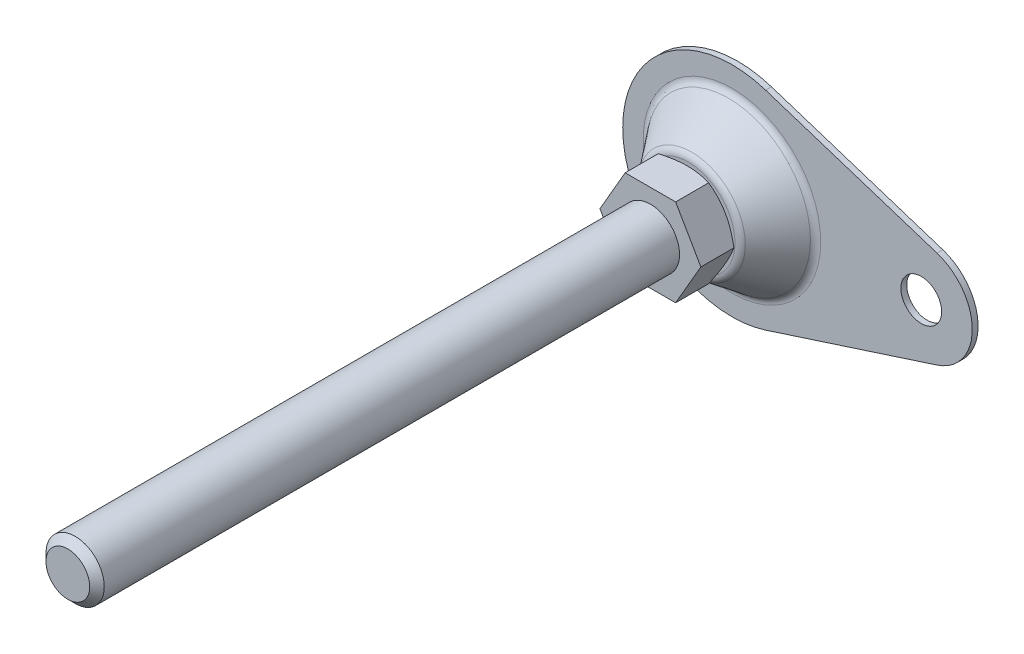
ISO-10303-21;
HEADER;
FILE_DESCRIPTION(('STEP AP214'),'2;1');
FILE_NAME('part.step','',(''),(''),'','','');
FILE_SCHEMA(('AUTOMOTIVE_DESIGN { 1 0 10303 214 1 1 1 1 }'));
ENDSEC;
DATA;
#1=APPLICATION_CONTEXT('core data for automotive mechanical design processes');
#2=APPLICATION_PROTOCOL_DEFINITION('international standard','automotive_design',2000,#1);
#3=PRODUCT_CONTEXT('',#1,'mechanical');
#4=PRODUCT('Part','Part','',(#3));
#5=PRODUCT_RELATED_PRODUCT_CATEGORY('part','',(#4));
#6=PRODUCT_DEFINITION_FORMATION('','',#4);
#7=PRODUCT_DEFINITION_CONTEXT('part definition',#1,'design');
#8=PRODUCT_DEFINITION('design','',#6,#7);
#9=PRODUCT_DEFINITION_SHAPE('','',#8);
#10=(LENGTH_UNIT() NAMED_UNIT(*) SI_UNIT(.MILLI.,.METRE.));
#11=(NAMED_UNIT(*) PLANE_ANGLE_UNIT() SI_UNIT($,.RADIAN.));
#12=(NAMED_UNIT(*) SI_UNIT($,.STERADIAN.) SOLID_ANGLE_UNIT());
#13=UNCERTAINTY_MEASURE_WITH_UNIT(LENGTH_MEASURE(1.E-05),#10,'distance_accuracy_value','');
#14=(GEOMETRIC_REPRESENTATION_CONTEXT(3) GLOBAL_UNCERTAINTY_ASSIGNED_CONTEXT((#13)) GLOBAL_UNIT_ASSIGNED_CONTEXT((#10,
#11,#12)) REPRESENTATION_CONTEXT('',''));
#15=CARTESIAN_POINT('',(0.,0.,0.));
#16=DIRECTION('',(0.,0.,1.));
#17=DIRECTION('',(1.,0.,0.));
#18=AXIS2_PLACEMENT_3D('',#15,#16,#17);
#19=CARTESIAN_POINT('',(65.,0.,2.));
#20=DIRECTION('',(0.,0.,1.));
#21=DIRECTION('',(1.,0.,0.));
#22=AXIS2_PLACEMENT_3D('',#19,#20,#21);
#23=PLANE('',#22);
#24=CARTESIAN_POINT('',(0.,0.,2.));
#25=DIRECTION('',(0.,0.,1.));
#26=DIRECTION('',(1.,0.,0.));
#27=AXIS2_PLACEMENT_3D('',#24,#25,#26);
#28=CIRCLE('',#27,30.4802116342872);
#29=CARTESIAN_POINT('',(30.4802116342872,0.,2.));
#30=VERTEX_POINT('',#29);
#31=EDGE_CURVE('E245',#30,#30,#28,.F.);
#32=ORIENTED_EDGE('',*,*,#31,.T.);
#33=EDGE_LOOP('',(#32));
#34=FACE_BOUND('',#33,.T.);
#35=CARTESIAN_POINT('',(65.,0.,2.));
#36=DIRECTION('',(0.,0.,1.));
#37=DIRECTION('',(1.,0.,0.));
#38=AXIS2_PLACEMENT_3D('',#35,#36,#37);
#39=CIRCLE('',#38,7.);
#40=CARTESIAN_POINT('',(72.,0.,2.));
#41=VERTEX_POINT('',#40);
#42=EDGE_CURVE('E262',#41,#41,#39,.T.);
#43=ORIENTED_EDGE('',*,*,#42,.F.);
#44=EDGE_LOOP('',(#43));
#45=FACE_BOUND('',#44,.T.);
#46=DIRECTION('',(-0.951485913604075,0.307692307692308,0.));
#47=VECTOR('',#46,1.);
#48=CARTESIAN_POINT('',(11.5384615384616,35.6807217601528,2.));
#49=LINE('',#48,#47);
#50=CARTESIAN_POINT('',(70.3846153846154,16.6510034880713,2.));
#51=VERTEX_POINT('',#50);
#52=CARTESIAN_POINT('',(11.5384615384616,35.6807217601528,2.));
#53=VERTEX_POINT('',#52);
#54=EDGE_CURVE('E112',#51,#53,#49,.T.);
#55=ORIENTED_EDGE('',*,*,#54,.T.);
#56=CARTESIAN_POINT('',(0.,0.,2.));
#57=DIRECTION('',(0.,0.,1.));
#58=DIRECTION('',(1.,0.,0.));
#59=AXIS2_PLACEMENT_3D('',#56,#57,#58);
#60=CIRCLE('',#59,37.5);
#61=CARTESIAN_POINT('',(11.5384615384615,-35.6807217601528,2.));
#62=VERTEX_POINT('',#61);
#63=EDGE_CURVE('E114',#53,#62,#60,.T.);
#64=ORIENTED_EDGE('',*,*,#63,.T.);
#65=DIRECTION('',(0.951485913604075,0.307692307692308,0.));
#66=VECTOR('',#65,1.);
#67=CARTESIAN_POINT('',(11.5384615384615,-35.6807217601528,2.));
#68=LINE('',#67,#66);
#69=CARTESIAN_POINT('',(70.3846153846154,-16.6510034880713,2.));
#70=VERTEX_POINT('',#69);
#71=EDGE_CURVE('E97',#62,#70,#68,.T.);
#72=ORIENTED_EDGE('',*,*,#71,.T.);
#73=CARTESIAN_POINT('',(65.,0.,2.));
#74=DIRECTION('',(0.,0.,1.));
#75=DIRECTION('',(1.,0.,0.));
#76=AXIS2_PLACEMENT_3D('',#73,#74,#75);
#77=CIRCLE('',#76,17.5);
#78=EDGE_CURVE('E106',#70,#51,#77,.T.);
#79=ORIENTED_EDGE('',*,*,#78,.T.);
#80=EDGE_LOOP('',(#55,#64,#72,#79));
#81=FACE_BOUND('',#80,.T.);
#82=ADVANCED_FACE('F14',(#34,#45,#81),#23,.T.);
#83=CARTESIAN_POINT('',(65.,0.,0.));
#84=DIRECTION('',(0.,0.,1.));
#85=DIRECTION('',(1.,0.,0.));
#86=AXIS2_PLACEMENT_3D('',#83,#84,#85);
#87=PLANE('',#86);
#88=CARTESIAN_POINT('',(65.,0.,0.));
#89=DIRECTION('',(0.,0.,1.));
#90=DIRECTION('',(1.,0.,0.));
#91=AXIS2_PLACEMENT_3D('',#88,#89,#90);
#92=CIRCLE('',#91,7.);
#93=CARTESIAN_POINT('',(72.,0.,0.));
#94=VERTEX_POINT('',#93);
#95=EDGE_CURVE('E258',#94,#94,#92,.T.);
#96=ORIENTED_EDGE('',*,*,#95,.T.);
#97=EDGE_LOOP('',(#96));
#98=FACE_BOUND('',#97,.T.);
#99=CARTESIAN_POINT('',(0.,0.,0.));
#100=DIRECTION('',(0.,0.,1.));
#101=DIRECTION('',(1.,0.,0.));
#102=AXIS2_PLACEMENT_3D('',#99,#100,#101);
#103=CIRCLE('',#102,37.5);
#104=CARTESIAN_POINT('',(11.5384615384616,35.6807217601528,0.));
#105=VERTEX_POINT('',#104);
#106=CARTESIAN_POINT('',(11.5384615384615,-35.6807217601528,0.));
#107=VERTEX_POINT('',#106);
#108=EDGE_CURVE('E275',#105,#107,#103,.T.);
#109=ORIENTED_EDGE('',*,*,#108,.F.);
#110=DIRECTION('',(-0.951485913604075,0.307692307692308,0.));
#111=VECTOR('',#110,1.);
#112=CARTESIAN_POINT('',(70.3846153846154,16.6510034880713,0.));
#113=LINE('',#112,#111);
#114=CARTESIAN_POINT('',(70.3846153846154,16.6510034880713,0.));
#115=VERTEX_POINT('',#114);
#116=EDGE_CURVE('E9',#115,#105,#113,.T.);
#117=ORIENTED_EDGE('',*,*,#116,.F.);
#118=CARTESIAN_POINT('',(65.,0.,0.));
#119=DIRECTION('',(0.,0.,1.));
#120=DIRECTION('',(1.,0.,0.));
#121=AXIS2_PLACEMENT_3D('',#118,#119,#120);
#122=CIRCLE('',#121,17.5);
#123=CARTESIAN_POINT('',(70.3846153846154,-16.6510034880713,0.));
#124=VERTEX_POINT('',#123);
#125=EDGE_CURVE('E22',#124,#115,#122,.T.);
#126=ORIENTED_EDGE('',*,*,#125,.F.);
#127=DIRECTION('',(0.951485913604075,0.307692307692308,0.));
#128=VECTOR('',#127,1.);
#129=CARTESIAN_POINT('',(70.3846153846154,-16.6510034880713,0.));
#130=LINE('',#129,#128);
#131=EDGE_CURVE('E99',#107,#124,#130,.T.);
#132=ORIENTED_EDGE('',*,*,#131,.F.);
#133=EDGE_LOOP('',(#109,#117,#126,#132));
#134=FACE_BOUND('',#133,.T.);
#135=ADVANCED_FACE('F215',(#98,#134),#87,.F.);
#136=CARTESIAN_POINT('',(0.,0.,17.));
#137=DIRECTION('',(0.,0.,-1.));
#138=DIRECTION('',(-1.,0.,0.));
#139=AXIS2_PLACEMENT_3D('',#136,#137,#138);
#140=PLANE('',#139);
#141=CARTESIAN_POINT('',(0.,0.,17.));
#142=DIRECTION('',(0.,0.,-1.));
#143=DIRECTION('',(-1.,0.,0.));
#144=AXIS2_PLACEMENT_3D('',#141,#142,#143);
#145=CIRCLE('',#144,16.0197883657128);
#146=CARTESIAN_POINT('',(-16.0197883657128,0.,17.));
#147=VERTEX_POINT('',#146);
#148=EDGE_CURVE('E278',#147,#147,#145,.F.);
#149=ORIENTED_EDGE('',*,*,#148,.T.);
#150=EDGE_LOOP('',(#149));
#151=FACE_BOUND('',#150,.T.);
#152=CARTESIAN_POINT('',(0.,0.,17.));
#153=DIRECTION('',(0.,0.,-1.));
#154=DIRECTION('',(-1.,0.,0.));
#155=AXIS2_PLACEMENT_3D('',#152,#153,#154);
#156=CIRCLE('',#155,14.5);
#157=CARTESIAN_POINT('',(-14.5,0.,17.));
#158=VERTEX_POINT('',#157);
#159=EDGE_CURVE('E122',#158,#158,#156,.T.);
#160=ORIENTED_EDGE('',*,*,#159,.T.);
#161=EDGE_LOOP('',(#160));
#162=FACE_BOUND('',#161,.T.);
#163=ADVANCED_FACE('F211',(#151,#162),#140,.F.);
#164=CARTESIAN_POINT('',(0.,0.,5.));
#165=DIRECTION('',(0.,0.,1.));
#166=DIRECTION('',(1.,0.,0.));
#167=AXIS2_PLACEMENT_3D('',#164,#165,#166);
#168=TOROIDAL_SURFACE('',#167,30.4802116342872,3.);
#169=CARTESIAN_POINT('',(0.,0.,3.1747053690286));
#170=DIRECTION('',(0.,0.,1.));
#171=DIRECTION('',(1.,0.,0.));
#172=AXIS2_PLACEMENT_3D('',#169,#170,#171);
#173=CIRCLE('',#172,28.0993925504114);
#174=CARTESIAN_POINT('',(28.0993925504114,0.,3.1747053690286));
#175=VERTEX_POINT('',#174);
#176=EDGE_CURVE('E242',#175,#175,#173,.T.);
#177=ORIENTED_EDGE('',*,*,#176,.F.);
#178=EDGE_LOOP('',(#177));
#179=FACE_BOUND('',#178,.T.);
#180=ORIENTED_EDGE('',*,*,#31,.F.);
#181=EDGE_LOOP('',(#180));
#182=FACE_BOUND('',#181,.T.);
#183=ADVANCED_FACE('F214',(#179,#182),#168,.F.);
#184=CARTESIAN_POINT('',(0.,0.,14.));
#185=DIRECTION('',(0.,0.,-1.));
#186=DIRECTION('',(-1.,0.,0.));
#187=AXIS2_PLACEMENT_3D('',#184,#185,#186);
#188=TOROIDAL_SURFACE('',#187,16.0197883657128,3.);
#189=ORIENTED_EDGE('',*,*,#148,.F.);
#190=EDGE_LOOP('',(#189));
#191=FACE_BOUND('',#190,.T.);
#192=CARTESIAN_POINT('',(0.,0.,15.8252946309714));
#193=DIRECTION('',(0.,0.,1.));
#194=DIRECTION('',(1.,0.,0.));
#195=AXIS2_PLACEMENT_3D('',#192,#193,#194);
#196=CIRCLE('',#195,18.4006074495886);
#197=CARTESIAN_POINT('',(18.4006074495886,0.,15.8252946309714));
#198=VERTEX_POINT('',#197);
#199=EDGE_CURVE('E251',#198,#198,#196,.F.);
#200=ORIENTED_EDGE('',*,*,#199,.F.);
#201=EDGE_LOOP('',(#200));
#202=FACE_BOUND('',#201,.T.);
#203=ADVANCED_FACE('F229',(#191,#202),#188,.T.);
#204=CARTESIAN_POINT('',(0.,0.,2.));
#205=DIRECTION('',(0.,0.,-1.));
#206=DIRECTION('',(-1.,0.,0.));
#207=AXIS2_PLACEMENT_3D('',#204,#205,#206);
#208=CYLINDRICAL_SURFACE('',#207,37.5);
#209=ORIENTED_EDGE('',*,*,#108,.T.);
#210=DIRECTION('',(0.,0.,1.));
#211=VECTOR('',#210,1.);
#212=CARTESIAN_POINT('',(11.5384615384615,-35.6807217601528,-8.));
#213=LINE('',#212,#211);
#214=EDGE_CURVE('E103',#107,#62,#213,.T.);
#215=ORIENTED_EDGE('',*,*,#214,.T.);
#216=ORIENTED_EDGE('',*,*,#63,.F.);
#217=DIRECTION('',(0.,0.,1.));
#218=VECTOR('',#217,1.);
#219=CARTESIAN_POINT('',(11.5384615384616,35.6807217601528,-8.));
#220=LINE('',#219,#218);
#221=EDGE_CURVE('E119',#105,#53,#220,.T.);
#222=ORIENTED_EDGE('',*,*,#221,.F.);
#223=EDGE_LOOP('',(#209,#215,#216,#222));
#224=FACE_BOUND('',#223,.T.);
#225=ADVANCED_FACE('F219',(#224),#208,.T.);
#226=CARTESIAN_POINT('',(65.,0.,2.));
#227=DIRECTION('',(0.,0.,-1.));
#228=DIRECTION('',(-1.,0.,0.));
#229=AXIS2_PLACEMENT_3D('',#226,#227,#228);
#230=CYLINDRICAL_SURFACE('',#229,7.);
#231=ORIENTED_EDGE('',*,*,#42,.T.);
#232=EDGE_LOOP('',(#231));
#233=FACE_BOUND('',#232,.T.);
#234=ORIENTED_EDGE('',*,*,#95,.F.);
#235=EDGE_LOOP('',(#234));
#236=FACE_BOUND('',#235,.T.);
#237=ADVANCED_FACE('F209',(#233,#236),#230,.F.);
#238=CARTESIAN_POINT('',(0.,0.,2.));
#239=DIRECTION('',(0.,0.,-1.));
#240=DIRECTION('',(-1.,0.,0.));
#241=AXIS2_PLACEMENT_3D('',#238,#239,#240);
#242=CONICAL_SURFACE('',#241,29.,0.654082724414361);
#243=ORIENTED_EDGE('',*,*,#176,.T.);
#244=EDGE_LOOP('',(#243));
#245=FACE_BOUND('',#244,.T.);
#246=ORIENTED_EDGE('',*,*,#199,.T.);
#247=EDGE_LOOP('',(#246));
#248=FACE_BOUND('',#247,.T.);
#249=ADVANCED_FACE('F151',(#245,#248),#242,.T.);
#250=CARTESIAN_POINT('',(0.,0.,17.));
#251=DIRECTION('',(0.,0.,1.));
#252=DIRECTION('',(1.,0.,0.));
#253=AXIS2_PLACEMENT_3D('',#250,#251,#252);
#254=CONICAL_SURFACE('',#253,14.5,1.0471975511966);
#255=ORIENTED_EDGE('',*,*,#159,.F.);
#256=EDGE_LOOP('',(#255));
#257=FACE_BOUND('',#256,.T.);
#258=CARTESIAN_POINT('',(17.3206235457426,0.000200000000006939,18.6284877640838));
#259=CARTESIAN_POINT('',(17.130274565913,-0.329494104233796,18.5185969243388));
#260=CARTESIAN_POINT('',(16.939183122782,-0.660474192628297,18.4136927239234));
#261=CARTESIAN_POINT('',(16.5554679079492,-1.32508844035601,18.2152437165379));
#262=CARTESIAN_POINT('',(16.3628436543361,-1.6587234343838,18.1217026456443));
#263=CARTESIAN_POINT('',(15.9756905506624,-2.32929228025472,17.9472372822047));
#264=CARTESIAN_POINT('',(15.7811583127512,-2.66623200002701,17.866342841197));
#265=CARTESIAN_POINT('',(15.3907420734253,-3.34245276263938,17.7189077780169));
#266=CARTESIAN_POINT('',(15.1948581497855,-3.68173367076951,17.6523663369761));
#267=CARTESIAN_POINT('',(14.8067578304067,-4.35394314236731,17.5364675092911));
#268=CARTESIAN_POINT('',(14.6145702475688,-4.68682180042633,17.4867265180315));
#269=CARTESIAN_POINT('',(14.2293144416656,-5.35410443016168,17.4033218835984));
#270=CARTESIAN_POINT('',(14.0362462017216,-5.68850843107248,17.3696585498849));
#271=CARTESIAN_POINT('',(13.6497853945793,-6.35787818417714,17.3192592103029));
#272=CARTESIAN_POINT('',(13.4563934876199,-6.69284279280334,17.3025030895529));
#273=CARTESIAN_POINT('',(13.0694311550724,-7.36308121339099,17.2862785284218));
#274=CARTESIAN_POINT('',(12.8758607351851,-7.69835501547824,17.2868095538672));
#275=CARTESIAN_POINT('',(12.5139822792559,-8.3251468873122,17.303951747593));
#276=CARTESIAN_POINT('',(12.3456484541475,-8.61670962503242,17.3184719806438));
#277=CARTESIAN_POINT('',(12.0093680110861,-9.19916443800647,17.3603122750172));
#278=CARTESIAN_POINT('',(11.8414214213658,-9.49005646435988,17.3876332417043));
#279=CARTESIAN_POINT('',(11.5060066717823,-10.0710118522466,17.4545986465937));
#280=CARTESIAN_POINT('',(11.338539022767,-10.3610743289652,17.4942532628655));
#281=CARTESIAN_POINT('',(11.0043888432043,-10.939839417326,17.5851902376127));
#282=CARTESIAN_POINT('',(10.8377063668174,-11.2285419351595,17.6364733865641));
#283=CARTESIAN_POINT('',(10.3317324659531,-12.1049144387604,17.8090619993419));
#284=CARTESIAN_POINT('',(9.99390625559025,-12.6900465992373,17.9475763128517));
#285=CARTESIAN_POINT('',(9.32329122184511,-13.8515859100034,18.26194710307));
#286=CARTESIAN_POINT('',(8.99049381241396,-14.4280079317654,18.4377297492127));
#287=CARTESIAN_POINT('',(8.66013856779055,-15.0002,18.6284877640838));
#288=B_SPLINE_CURVE_WITH_KNOTS('',3,(#258,#259,#260,#261,#262,#263,#264,#265,#266,#267,#268,
#269,#270,#271,#272,#273,#274,#275,#276,#277,#278,#279,#280,#281,#282,#283,#284,#285,#286,#287),
.UNSPECIFIED.,.F.,.F.,(4,2,2,2,2,2,2,2,2,2,2,2,2,2,4),(0.,1.18875411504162,2.37789802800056,
3.56980778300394,4.76164951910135,5.92407379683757,7.0865204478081,8.24758247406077,
9.40860862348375,10.4193068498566,11.4300765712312,12.4416826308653,13.4533574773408,
15.5211962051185,17.5849760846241),.UNSPECIFIED.);
#289=CARTESIAN_POINT('',(17.3205080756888,0.,18.6284210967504));
#290=VERTEX_POINT('',#289);
#291=CARTESIAN_POINT('',(8.66025403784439,-15.,18.6284210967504));
#292=VERTEX_POINT('',#291);
#293=EDGE_CURVE('E29',#290,#292,#288,.T.);
#294=ORIENTED_EDGE('',*,*,#293,.T.);
#295=CARTESIAN_POINT('',(-23.3586985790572,-15.,24.6557810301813));
#296=CARTESIAN_POINT('',(-23.0306759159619,-15.,24.4964278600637));
#297=CARTESIAN_POINT('',(-22.7022708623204,-15.,24.3378621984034));
#298=CARTESIAN_POINT('',(-22.0446161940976,-15.,24.0224840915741));
#299=CARTESIAN_POINT('',(-21.7153665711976,-15.,23.8656716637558));
#300=CARTESIAN_POINT('',(-20.7261447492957,-15.,23.3980907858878));
#301=CARTESIAN_POINT('',(-20.0647952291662,-15.,23.090225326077));
#302=CARTESIAN_POINT('',(-18.7341494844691,-15.,22.4824434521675));
#303=CARTESIAN_POINT('',(-18.0648296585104,-15.,22.1825785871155));
#304=CARTESIAN_POINT('',(-16.7208994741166,-15.,21.594991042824));
#305=CARTESIAN_POINT('',(-16.0462893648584,-15.,21.3072677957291));
#306=CARTESIAN_POINT('',(-14.668785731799,-15.,20.7381173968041));
#307=CARTESIAN_POINT('',(-13.9656828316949,-15.,20.4571943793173));
#308=CARTESIAN_POINT('',(-12.551282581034,-15.,19.9163766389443));
#309=CARTESIAN_POINT('',(-11.8399843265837,-15.,19.6564842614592));
#310=CARTESIAN_POINT('',(-10.4093840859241,-15.,19.1644824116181));
#311=CARTESIAN_POINT('',(-9.69010129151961,-15.,18.9323175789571));
#312=CARTESIAN_POINT('',(-8.24115179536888,-15.,18.5031423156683));
#313=CARTESIAN_POINT('',(-7.51148840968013,-15.,18.3061209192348));
#314=CARTESIAN_POINT('',(-6.41103708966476,-15.,18.0445520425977));
#315=CARTESIAN_POINT('',(-6.04422074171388,-15.,17.9631963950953));
#316=CARTESIAN_POINT('',(-5.308063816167,-15.,17.8127743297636));
#317=CARTESIAN_POINT('',(-4.9387232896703,-15.,17.7437076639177));
#318=CARTESIAN_POINT('',(-4.19776624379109,-15.,17.6190768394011));
#319=CARTESIAN_POINT('',(-3.82614976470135,-15.,17.5635124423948));
#320=CARTESIAN_POINT('',(-3.08102773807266,-15.,17.4669909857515));
#321=CARTESIAN_POINT('',(-2.70752227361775,-15.,17.426033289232));
#322=CARTESIAN_POINT('',(-1.96406382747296,-15.,17.3600577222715));
#323=CARTESIAN_POINT('',(-1.59412898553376,-15.,17.3348366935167));
#324=CARTESIAN_POINT('',(-0.853524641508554,-15.,17.300066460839));
#325=CARTESIAN_POINT('',(-0.482855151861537,-15.,17.2905169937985));
#326=CARTESIAN_POINT('',(0.25855959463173,-15.,17.287317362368));
#327=CARTESIAN_POINT('',(0.629304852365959,-15.,17.2936673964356));
#328=CARTESIAN_POINT('',(1.37019516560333,-15.,17.3221110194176));
#329=CARTESIAN_POINT('',(1.7403401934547,-15.,17.3442053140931));
#330=CARTESIAN_POINT('',(2.62681140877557,-15.,17.4155020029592));
#331=CARTESIAN_POINT('',(3.14256120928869,-15.,17.4720015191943));
#332=CARTESIAN_POINT('',(4.17030104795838,-15.,17.6125153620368));
#333=CARTESIAN_POINT('',(4.68229057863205,-15.,17.6965333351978));
#334=CARTESIAN_POINT('',(5.70198989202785,-15.,17.8890956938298));
#335=CARTESIAN_POINT('',(6.20969617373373,-15.,17.9976584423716));
#336=CARTESIAN_POINT('',(7.22005088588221,-15.,18.2359950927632));
#337=CARTESIAN_POINT('',(7.72269938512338,-15.,18.3657687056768));
#338=CARTESIAN_POINT('',(8.73446067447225,-15.,18.6465622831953));
#339=CARTESIAN_POINT('',(9.24345603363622,-15.,18.7980024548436));
#340=CARTESIAN_POINT('',(10.2564317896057,-15.,19.1167327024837));
#341=CARTESIAN_POINT('',(10.7604121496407,-15.,19.2840228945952));
#342=CARTESIAN_POINT('',(11.763609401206,-15.,19.631778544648));
#343=CARTESIAN_POINT('',(12.262827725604,-15.,19.8122398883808));
#344=CARTESIAN_POINT('',(13.2571080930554,-15.,20.1841942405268));
#345=CARTESIAN_POINT('',(13.7521702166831,-15.,20.37568703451));
#346=CARTESIAN_POINT('',(15.0416273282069,-15.,20.8883338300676));
#347=CARTESIAN_POINT('',(15.8330826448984,-15.,21.2168757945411));
#348=CARTESIAN_POINT('',(17.4082740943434,-15.,21.892031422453));
#349=CARTESIAN_POINT('',(18.1920094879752,-15.,22.238646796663));
#350=CARTESIAN_POINT('',(19.7534528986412,-15.,22.9458287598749));
#351=CARTESIAN_POINT('',(20.5311588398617,-15.,23.3063999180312));
#352=CARTESIAN_POINT('',(22.0814515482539,-15.,24.0382834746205));
#353=CARTESIAN_POINT('',(22.854038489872,-15.,24.409595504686));
#354=CARTESIAN_POINT('',(24.3961771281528,-15.,25.16124198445));
#355=CARTESIAN_POINT('',(25.1657228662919,-15.,25.5415886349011));
#356=CARTESIAN_POINT('',(26.7014145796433,-15.,26.3090870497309));
#357=CARTESIAN_POINT('',(27.4675605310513,-15.,26.6962388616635));
#358=CARTESIAN_POINT('',(28.9968968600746,-15.,27.4759792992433));
#359=CARTESIAN_POINT('',(29.7600877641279,-15.,27.868566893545));
#360=CARTESIAN_POINT('',(31.2841223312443,-15.,28.6582620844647));
#361=CARTESIAN_POINT('',(32.0449660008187,-15.,29.0553696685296));
#362=CARTESIAN_POINT('',(34.1728821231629,-15.,30.1726464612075));
#363=CARTESIAN_POINT('',(35.53776001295,-15.,30.8969946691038));
#364=CARTESIAN_POINT('',(38.2628692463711,-15.,32.3545315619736));
#365=CARTESIAN_POINT('',(39.6231003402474,-15.,33.0877207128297));
#366=CARTESIAN_POINT('',(42.3358122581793,-15.,34.5584832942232));
#367=CARTESIAN_POINT('',(43.6883040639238,-15.,35.2960364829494));
#368=CARTESIAN_POINT('',(45.7149038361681,-15.,36.4061528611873));
#369=CARTESIAN_POINT('',(46.3900573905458,-15.,36.776809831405));
#370=CARTESIAN_POINT('',(47.7397408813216,-15.,37.5192554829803));
#371=CARTESIAN_POINT('',(48.4142708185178,-15.,37.891044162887));
#372=CARTESIAN_POINT('',(49.0885264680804,-15.,38.2633297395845));
#373=B_SPLINE_CURVE_WITH_KNOTS('',3,(#295,#296,#297,#298,#299,#300,#301,#302,#303,#304,#305,
#306,#307,#308,#309,#310,#311,#312,#313,#314,#315,#316,#317,#318,#319,#320,#321,#322,#323,#324,
#325,#326,#327,#328,#329,#330,#331,#332,#333,#334,#335,#336,#337,#338,#339,#340,#341,#342,#343,
#344,#345,#346,#347,#348,#349,#350,#351,#352,#353,#354,#355,#356,#357,#358,#359,#360,#361,#362,
#363,#364,#365,#366,#367,#368,#369,#370,#371,#372),.UNSPECIFIED.,.F.,.F.,(4,2,2,2,2,2,2,2,2,2,2,
2,2,2,2,2,2,2,2,2,2,2,2,2,2,2,2,2,2,2,2,2,2,2,2,2,2,2,4),(0.,1.09404132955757,2.18809347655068,
4.37651687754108,6.57668915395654,8.77675841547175,11.0479422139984,13.3193789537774,
15.586201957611,17.8523164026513,18.9793336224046,20.1063280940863,21.2333026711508,
22.3602281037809,23.4722865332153,24.5843262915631,25.6963799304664,26.8084834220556,
28.3641313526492,29.9199855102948,31.4770075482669,33.0340083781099,34.626839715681,
36.2196827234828,37.8120302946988,39.4043469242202,41.9748287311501,44.5455542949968,
47.1171287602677,49.6886151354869,52.2637974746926,54.8389978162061,57.4137160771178,
59.9884271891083,64.6239079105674,69.2596339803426,73.8811953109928,76.1918156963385,
78.5024331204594),.UNSPECIFIED.);
#374=CARTESIAN_POINT('',(-8.66025403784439,-15.,18.6284210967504));
#375=VERTEX_POINT('',#374);
#376=EDGE_CURVE('E158',#292,#375,#373,.F.);
#377=ORIENTED_EDGE('',*,*,#376,.T.);
#378=CARTESIAN_POINT('',(-8.66013856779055,-15.0002,18.6284877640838));
#379=CARTESIAN_POINT('',(-8.85048754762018,-14.6705058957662,18.5185969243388));
#380=CARTESIAN_POINT('',(-9.04157899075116,-14.3395258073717,18.4136927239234));
#381=CARTESIAN_POINT('',(-9.42529420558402,-13.674911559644,18.2152437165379));
#382=CARTESIAN_POINT('',(-9.61791845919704,-13.3412765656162,18.1217026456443));
#383=CARTESIAN_POINT('',(-10.0050715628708,-12.6707077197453,17.9472372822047));
#384=CARTESIAN_POINT('',(-10.199603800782,-12.333767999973,17.866342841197));
#385=CARTESIAN_POINT('',(-10.5900200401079,-11.6575472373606,17.7189077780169));
#386=CARTESIAN_POINT('',(-10.7859039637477,-11.3182663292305,17.6523663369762));
#387=CARTESIAN_POINT('',(-11.1740042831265,-10.6460568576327,17.5364675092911));
#388=CARTESIAN_POINT('',(-11.3661918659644,-10.3131781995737,17.4867265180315));
#389=CARTESIAN_POINT('',(-11.7514476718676,-9.64589556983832,17.4033218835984));
#390=CARTESIAN_POINT('',(-11.9445159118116,-9.31149156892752,17.3696585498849));
#391=CARTESIAN_POINT('',(-12.3309767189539,-8.64212181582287,17.3192592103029));
#392=CARTESIAN_POINT('',(-12.5243686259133,-8.30715720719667,17.3025030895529));
#393=CARTESIAN_POINT('',(-12.9113309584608,-7.63691878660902,17.2862785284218));
#394=CARTESIAN_POINT('',(-13.1049013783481,-7.30164498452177,17.2868095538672));
#395=CARTESIAN_POINT('',(-13.4667798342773,-6.67485311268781,17.303951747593));
#396=CARTESIAN_POINT('',(-13.6351136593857,-6.38329037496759,17.3184719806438));
#397=CARTESIAN_POINT('',(-13.9713941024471,-5.80083556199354,17.3603122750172));
#398=CARTESIAN_POINT('',(-14.1393406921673,-5.50994353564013,17.3876332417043));
#399=CARTESIAN_POINT('',(-14.4747554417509,-4.92898814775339,17.4545986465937));
#400=CARTESIAN_POINT('',(-14.6422230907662,-4.63892567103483,17.4942532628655));
#401=CARTESIAN_POINT('',(-14.9763732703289,-4.06016058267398,17.5851902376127));
#402=CARTESIAN_POINT('',(-15.1430557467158,-3.77145806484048,17.6364733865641));
#403=CARTESIAN_POINT('',(-15.6490296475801,-2.8950855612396,17.8090619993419));
#404=CARTESIAN_POINT('',(-15.9868558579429,-2.30995340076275,17.9475763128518));
#405=CARTESIAN_POINT('',(-16.6574708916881,-1.14841408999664,18.26194710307));
#406=CARTESIAN_POINT('',(-16.9902683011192,-0.57199206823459,18.4377297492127));
#407=CARTESIAN_POINT('',(-17.3206235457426,0.000199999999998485,18.6284877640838));
#408=B_SPLINE_CURVE_WITH_KNOTS('',3,(#378,#379,#380,#381,#382,#383,#384,#385,#386,#387,#388,
#389,#390,#391,#392,#393,#394,#395,#396,#397,#398,#399,#400,#401,#402,#403,#404,#405,#406,#407),
.UNSPECIFIED.,.F.,.F.,(4,2,2,2,2,2,2,2,2,2,2,2,2,2,4),(0.,1.18875411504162,2.37789802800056,
3.56980778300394,4.76164951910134,5.92407379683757,7.0865204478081,8.24758247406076,
9.40860862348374,10.4193068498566,11.4300765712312,12.4416826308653,13.4533574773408,
15.5211962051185,17.5849760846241),.UNSPECIFIED.);
#409=CARTESIAN_POINT('',(-17.3205080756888,0.,18.6284210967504));
#410=VERTEX_POINT('',#409);
#411=EDGE_CURVE('E127',#375,#410,#408,.T.);
#412=ORIENTED_EDGE('',*,*,#411,.T.);
#413=CARTESIAN_POINT('',(-17.3206235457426,-0.0002,18.6284877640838));
#414=CARTESIAN_POINT('',(-17.130274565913,0.329494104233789,18.5185969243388));
#415=CARTESIAN_POINT('',(-16.939183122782,0.660474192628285,18.4136927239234));
#416=CARTESIAN_POINT('',(-16.5554679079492,1.325088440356,18.2152437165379));
#417=CARTESIAN_POINT('',(-16.3628436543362,1.65872343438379,18.1217026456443));
#418=CARTESIAN_POINT('',(-15.9756905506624,2.32929228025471,17.9472372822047));
#419=CARTESIAN_POINT('',(-15.7811583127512,2.666232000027,17.866342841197));
#420=CARTESIAN_POINT('',(-15.3907420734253,3.34245276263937,17.7189077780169));
#421=CARTESIAN_POINT('',(-15.1948581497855,3.6817336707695,17.6523663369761));
#422=CARTESIAN_POINT('',(-14.8067578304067,4.3539431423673,17.5364675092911));
#423=CARTESIAN_POINT('',(-14.6145702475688,4.68682180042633,17.4867265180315));
#424=CARTESIAN_POINT('',(-14.2293144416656,5.35410443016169,17.4033218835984));
#425=CARTESIAN_POINT('',(-14.0362462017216,5.68850843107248,17.3696585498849));
#426=CARTESIAN_POINT('',(-13.6497853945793,6.35787818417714,17.3192592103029));
#427=CARTESIAN_POINT('',(-13.4563934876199,6.69284279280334,17.3025030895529));
#428=CARTESIAN_POINT('',(-13.0694311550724,7.363081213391,17.2862785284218));
#429=CARTESIAN_POINT('',(-12.8758607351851,7.69835501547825,17.2868095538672));
#430=CARTESIAN_POINT('',(-12.5139822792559,8.32514688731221,17.303951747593));
#431=CARTESIAN_POINT('',(-12.3456484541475,8.61670962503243,17.3184719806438));
#432=CARTESIAN_POINT('',(-12.0093680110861,9.19916443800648,17.3603122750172));
#433=CARTESIAN_POINT('',(-11.8414214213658,9.49005646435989,17.3876332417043));
#434=CARTESIAN_POINT('',(-11.5060066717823,10.0710118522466,17.4545986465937));
#435=CARTESIAN_POINT('',(-11.338539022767,10.3610743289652,17.4942532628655));
#436=CARTESIAN_POINT('',(-11.0043888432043,10.939839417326,17.5851902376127));
#437=CARTESIAN_POINT('',(-10.8377063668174,11.2285419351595,17.6364733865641));
#438=CARTESIAN_POINT('',(-10.3317324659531,12.1049144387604,17.8090619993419));
#439=CARTESIAN_POINT('',(-9.99390625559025,12.6900465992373,17.9475763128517));
#440=CARTESIAN_POINT('',(-9.32329122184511,13.8515859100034,18.26194710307));
#441=CARTESIAN_POINT('',(-8.99049381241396,14.4280079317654,18.4377297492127));
#442=CARTESIAN_POINT('',(-8.66013856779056,15.0002,18.6284877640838));
#443=B_SPLINE_CURVE_WITH_KNOTS('',3,(#413,#414,#415,#416,#417,#418,#419,#420,#421,#422,#423,
#424,#425,#426,#427,#428,#429,#430,#431,#432,#433,#434,#435,#436,#437,#438,#439,#440,#441,#442),
.UNSPECIFIED.,.F.,.F.,(4,2,2,2,2,2,2,2,2,2,2,2,2,2,4),(0.,1.18875411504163,2.37789802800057,
3.56980778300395,4.76164951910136,5.92407379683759,7.08652044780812,8.24758247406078,
9.40860862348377,10.4193068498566,11.4300765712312,12.4416826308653,13.4533574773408,
15.5211962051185,17.5849760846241),.UNSPECIFIED.);
#444=CARTESIAN_POINT('',(-8.66025403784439,15.,18.6284210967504));
#445=VERTEX_POINT('',#444);
#446=EDGE_CURVE('E135',#410,#445,#443,.T.);
#447=ORIENTED_EDGE('',*,*,#446,.T.);
#448=CARTESIAN_POINT('',(-23.3586985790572,15.,24.6557810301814));
#449=CARTESIAN_POINT('',(-23.030675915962,15.,24.4964278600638));
#450=CARTESIAN_POINT('',(-22.7022708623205,15.,24.3378621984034));
#451=CARTESIAN_POINT('',(-22.0446161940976,15.,24.0224840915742));
#452=CARTESIAN_POINT('',(-21.7153665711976,15.,23.8656716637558));
#453=CARTESIAN_POINT('',(-20.7261447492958,15.,23.3980907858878));
#454=CARTESIAN_POINT('',(-20.0647952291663,15.,23.090225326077));
#455=CARTESIAN_POINT('',(-18.7341494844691,15.,22.4824434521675));
#456=CARTESIAN_POINT('',(-18.0648296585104,15.,22.1825785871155));
#457=CARTESIAN_POINT('',(-16.7208994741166,15.,21.594991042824));
#458=CARTESIAN_POINT('',(-16.0462893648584,15.,21.3072677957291));
#459=CARTESIAN_POINT('',(-14.668785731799,15.,20.7381173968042));
#460=CARTESIAN_POINT('',(-13.965682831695,15.,20.4571943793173));
#461=CARTESIAN_POINT('',(-12.551282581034,15.,19.9163766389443));
#462=CARTESIAN_POINT('',(-11.8399843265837,15.,19.6564842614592));
#463=CARTESIAN_POINT('',(-10.4093840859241,15.,19.1644824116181));
#464=CARTESIAN_POINT('',(-9.69010129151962,15.,18.9323175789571));
#465=CARTESIAN_POINT('',(-8.24115179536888,15.,18.5031423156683));
#466=CARTESIAN_POINT('',(-7.51148840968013,15.,18.3061209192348));
#467=CARTESIAN_POINT('',(-6.41103708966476,15.,18.0445520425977));
#468=CARTESIAN_POINT('',(-6.04422074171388,15.,17.9631963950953));
#469=CARTESIAN_POINT('',(-5.308063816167,15.,17.8127743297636));
#470=CARTESIAN_POINT('',(-4.9387232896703,15.,17.7437076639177));
#471=CARTESIAN_POINT('',(-4.19776624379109,15.,17.6190768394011));
#472=CARTESIAN_POINT('',(-3.82614976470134,15.,17.5635124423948));
#473=CARTESIAN_POINT('',(-3.08102773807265,15.,17.4669909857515));
#474=CARTESIAN_POINT('',(-2.70752227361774,15.,17.426033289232));
#475=CARTESIAN_POINT('',(-1.96406382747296,15.,17.3600577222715));
#476=CARTESIAN_POINT('',(-1.59412898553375,15.,17.3348366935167));
#477=CARTESIAN_POINT('',(-0.853524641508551,15.,17.300066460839));
#478=CARTESIAN_POINT('',(-0.482855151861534,15.,17.2905169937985));
#479=CARTESIAN_POINT('',(0.258559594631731,15.,17.287317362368));
#480=CARTESIAN_POINT('',(0.62930485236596,15.,17.2936673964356));
#481=CARTESIAN_POINT('',(1.37019516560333,15.,17.3221110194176));
#482=CARTESIAN_POINT('',(1.7403401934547,15.,17.3442053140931));
#483=CARTESIAN_POINT('',(2.62681140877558,15.,17.4155020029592));
#484=CARTESIAN_POINT('',(3.1425612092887,15.,17.4720015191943));
#485=CARTESIAN_POINT('',(4.17030104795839,15.,17.6125153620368));
#486=CARTESIAN_POINT('',(4.68229057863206,15.,17.6965333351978));
#487=CARTESIAN_POINT('',(5.70198989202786,15.,17.8890956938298));
#488=CARTESIAN_POINT('',(6.20969617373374,15.,17.9976584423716));
#489=CARTESIAN_POINT('',(7.22005088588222,15.,18.2359950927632));
#490=CARTESIAN_POINT('',(7.72269938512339,15.,18.3657687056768));
#491=CARTESIAN_POINT('',(8.73446067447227,15.,18.6465622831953));
#492=CARTESIAN_POINT('',(9.24345603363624,15.,18.7980024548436));
#493=CARTESIAN_POINT('',(10.2564317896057,15.,19.1167327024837));
#494=CARTESIAN_POINT('',(10.7604121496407,15.,19.2840228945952));
#495=CARTESIAN_POINT('',(11.763609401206,15.,19.631778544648));
#496=CARTESIAN_POINT('',(12.262827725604,15.,19.8122398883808));
#497=CARTESIAN_POINT('',(13.2571080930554,15.,20.1841942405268));
#498=CARTESIAN_POINT('',(13.7521702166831,15.,20.37568703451));
#499=CARTESIAN_POINT('',(15.0416273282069,15.,20.8883338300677));
#500=CARTESIAN_POINT('',(15.8330826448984,15.,21.2168757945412));
#501=CARTESIAN_POINT('',(17.4082740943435,15.,21.892031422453));
#502=CARTESIAN_POINT('',(18.1920094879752,15.,22.238646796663));
#503=CARTESIAN_POINT('',(19.7534528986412,15.,22.9458287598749));
#504=CARTESIAN_POINT('',(20.5311588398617,15.,23.3063999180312));
#505=CARTESIAN_POINT('',(22.081451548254,15.,24.0382834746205));
#506=CARTESIAN_POINT('',(22.8540384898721,15.,24.409595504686));
#507=CARTESIAN_POINT('',(24.3961771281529,15.,25.16124198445));
#508=CARTESIAN_POINT('',(25.1657228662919,15.,25.5415886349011));
#509=CARTESIAN_POINT('',(26.7014145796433,15.,26.3090870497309));
#510=CARTESIAN_POINT('',(27.4675605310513,15.,26.6962388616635));
#511=CARTESIAN_POINT('',(28.9968968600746,15.,27.4759792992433));
#512=CARTESIAN_POINT('',(29.7600877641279,15.,27.868566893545));
#513=CARTESIAN_POINT('',(31.2841223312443,15.,28.6582620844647));
#514=CARTESIAN_POINT('',(32.0449660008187,15.,29.0553696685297));
#515=CARTESIAN_POINT('',(34.1728821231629,15.,30.1726464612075));
#516=CARTESIAN_POINT('',(35.53776001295,15.,30.8969946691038));
#517=CARTESIAN_POINT('',(38.2628692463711,15.,32.3545315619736));
#518=CARTESIAN_POINT('',(39.6231003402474,15.,33.0877207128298));
#519=CARTESIAN_POINT('',(42.3358122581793,15.,34.5584832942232));
#520=CARTESIAN_POINT('',(43.6883040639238,15.,35.2960364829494));
#521=CARTESIAN_POINT('',(45.7149038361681,15.,36.4061528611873));
#522=CARTESIAN_POINT('',(46.3900573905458,15.,36.776809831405));
#523=CARTESIAN_POINT('',(47.7397408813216,15.,37.5192554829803));
#524=CARTESIAN_POINT('',(48.4142708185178,15.,37.891044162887));
#525=CARTESIAN_POINT('',(49.0885264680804,15.,38.2633297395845));
#526=B_SPLINE_CURVE_WITH_KNOTS('',3,(#448,#449,#450,#451,#452,#453,#454,#455,#456,#457,#458,
#459,#460,#461,#462,#463,#464,#465,#466,#467,#468,#469,#470,#471,#472,#473,#474,#475,#476,#477,
#478,#479,#480,#481,#482,#483,#484,#485,#486,#487,#488,#489,#490,#491,#492,#493,#494,#495,#496,
#497,#498,#499,#500,#501,#502,#503,#504,#505,#506,#507,#508,#509,#510,#511,#512,#513,#514,#515,
#516,#517,#518,#519,#520,#521,#522,#523,#524,#525),.UNSPECIFIED.,.F.,.F.,(4,2,2,2,2,2,2,2,2,2,2,
2,2,2,2,2,2,2,2,2,2,2,2,2,2,2,2,2,2,2,2,2,2,2,2,2,2,2,4),(0.,1.09404132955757,2.18809347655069,
4.37651687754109,6.57668915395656,8.77675841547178,11.0479422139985,13.3193789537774,
15.586201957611,17.8523164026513,18.9793336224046,20.1063280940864,21.2333026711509,
22.360228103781,23.4722865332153,24.5843262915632,25.6963799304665,26.8084834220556,
28.3641313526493,29.9199855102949,31.477007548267,33.03400837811,34.6268397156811,
36.2196827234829,37.8120302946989,39.4043469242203,41.9748287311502,44.5455542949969,
47.1171287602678,49.688615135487,52.2637974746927,54.8389978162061,57.4137160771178,
59.9884271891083,64.6239079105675,69.2596339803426,73.8811953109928,76.1918156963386,
78.5024331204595),.UNSPECIFIED.);
#527=CARTESIAN_POINT('',(8.66025403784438,15.,18.6284210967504));
#528=VERTEX_POINT('',#527);
#529=EDGE_CURVE('E169',#445,#528,#526,.T.);
#530=ORIENTED_EDGE('',*,*,#529,.T.);
#531=CARTESIAN_POINT('',(8.66013856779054,15.0002,18.6284877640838));
#532=CARTESIAN_POINT('',(8.85048754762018,14.6705058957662,18.5185969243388));
#533=CARTESIAN_POINT('',(9.04157899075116,14.3395258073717,18.4136927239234));
#534=CARTESIAN_POINT('',(9.42529420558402,13.674911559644,18.2152437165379));
#535=CARTESIAN_POINT('',(9.61791845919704,13.3412765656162,18.1217026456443));
#536=CARTESIAN_POINT('',(10.0050715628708,12.6707077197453,17.9472372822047));
#537=CARTESIAN_POINT('',(10.199603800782,12.333767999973,17.866342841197));
#538=CARTESIAN_POINT('',(10.5900200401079,11.6575472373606,17.7189077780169));
#539=CARTESIAN_POINT('',(10.7859039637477,11.3182663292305,17.6523663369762));
#540=CARTESIAN_POINT('',(11.1740042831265,10.6460568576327,17.5364675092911));
#541=CARTESIAN_POINT('',(11.3661918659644,10.3131781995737,17.4867265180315));
#542=CARTESIAN_POINT('',(11.7514476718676,9.64589556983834,17.4033218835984));
#543=CARTESIAN_POINT('',(11.9445159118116,9.31149156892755,17.3696585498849));
#544=CARTESIAN_POINT('',(12.3309767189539,8.64212181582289,17.3192592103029));
#545=CARTESIAN_POINT('',(12.5243686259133,8.3071572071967,17.3025030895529));
#546=CARTESIAN_POINT('',(12.9113309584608,7.63691878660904,17.2862785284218));
#547=CARTESIAN_POINT('',(13.104901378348,7.30164498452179,17.2868095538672));
#548=CARTESIAN_POINT('',(13.4667798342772,6.67485311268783,17.303951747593));
#549=CARTESIAN_POINT('',(13.6351136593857,6.38329037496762,17.3184719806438));
#550=CARTESIAN_POINT('',(13.9713941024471,5.80083556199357,17.3603122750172));
#551=CARTESIAN_POINT('',(14.1393406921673,5.50994353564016,17.3876332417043));
#552=CARTESIAN_POINT('',(14.4747554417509,4.92898814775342,17.4545986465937));
#553=CARTESIAN_POINT('',(14.6422230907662,4.63892567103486,17.4942532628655));
#554=CARTESIAN_POINT('',(14.9763732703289,4.06016058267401,17.5851902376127));
#555=CARTESIAN_POINT('',(15.1430557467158,3.77145806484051,17.6364733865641));
#556=CARTESIAN_POINT('',(15.6490296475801,2.89508556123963,17.8090619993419));
#557=CARTESIAN_POINT('',(15.9868558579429,2.30995340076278,17.9475763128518));
#558=CARTESIAN_POINT('',(16.6574708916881,1.14841408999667,18.26194710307));
#559=CARTESIAN_POINT('',(16.9902683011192,0.571992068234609,18.4377297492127));
#560=CARTESIAN_POINT('',(17.3206235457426,-0.000199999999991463,18.6284877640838));
#561=B_SPLINE_CURVE_WITH_KNOTS('',3,(#531,#532,#533,#534,#535,#536,#537,#538,#539,#540,#541,
#542,#543,#544,#545,#546,#547,#548,#549,#550,#551,#552,#553,#554,#555,#556,#557,#558,#559,#560),
.UNSPECIFIED.,.F.,.F.,(4,2,2,2,2,2,2,2,2,2,2,2,2,2,4),(0.,1.18875411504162,2.37789802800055,
3.56980778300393,4.76164951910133,5.92407379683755,7.08652044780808,8.24758247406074,
9.40860862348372,10.4193068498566,11.4300765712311,12.4416826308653,13.4533574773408,
15.5211962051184,17.584976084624),.UNSPECIFIED.);
#562=EDGE_CURVE('E176',#528,#290,#561,.T.);
#563=ORIENTED_EDGE('',*,*,#562,.T.);
#564=EDGE_LOOP('',(#294,#377,#412,#447,#530,#563));
#565=FACE_BOUND('',#564,.T.);
#566=ADVANCED_FACE('F145',(#257,#565),#254,.T.);
#567=CARTESIAN_POINT('',(0.,0.,230.));
#568=DIRECTION('',(0.,0.,1.));
#569=DIRECTION('',(1.,0.,0.));
#570=AXIS2_PLACEMENT_3D('',#567,#568,#569);
#571=PLANE('',#570);
#572=CARTESIAN_POINT('',(0.,0.,230.));
#573=DIRECTION('',(0.,0.,1.));
#574=DIRECTION('',(1.,0.,0.));
#575=AXIS2_PLACEMENT_3D('',#572,#573,#574);
#576=CIRCLE('',#575,7.5);
#577=CARTESIAN_POINT('',(7.5,0.,230.));
#578=VERTEX_POINT('',#577);
#579=EDGE_CURVE('E246',#578,#578,#576,.T.);
#580=ORIENTED_EDGE('',*,*,#579,.T.);
#581=EDGE_LOOP('',(#580));
#582=FACE_BOUND('',#581,.T.);
#583=ADVANCED_FACE('F150',(#582),#571,.T.);
#584=CARTESIAN_POINT('',(0.,0.,230.));
#585=DIRECTION('',(0.,0.,-1.));
#586=DIRECTION('',(-1.,0.,0.));
#587=AXIS2_PLACEMENT_3D('',#584,#585,#586);
#588=CONICAL_SURFACE('',#587,7.5,0.785398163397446);
#589=CARTESIAN_POINT('',(0.,0.,227.5));
#590=DIRECTION('',(0.,0.,1.));
#591=DIRECTION('',(1.,0.,0.));
#592=AXIS2_PLACEMENT_3D('',#589,#590,#591);
#593=CIRCLE('',#592,10.);
#594=CARTESIAN_POINT('',(10.,0.,227.5));
#595=VERTEX_POINT('',#594);
#596=EDGE_CURVE('E249',#595,#595,#593,.F.);
#597=ORIENTED_EDGE('',*,*,#596,.F.);
#598=EDGE_LOOP('',(#597));
#599=FACE_BOUND('',#598,.T.);
#600=ORIENTED_EDGE('',*,*,#579,.F.);
#601=EDGE_LOOP('',(#600));
#602=FACE_BOUND('',#601,.T.);
#603=ADVANCED_FACE('F16',(#599,#602),#588,.T.);
#604=CARTESIAN_POINT('',(0.,0.,230.));
#605=DIRECTION('',(0.,0.,-1.));
#606=DIRECTION('',(-1.,0.,0.));
#607=AXIS2_PLACEMENT_3D('',#604,#605,#606);
#608=CYLINDRICAL_SURFACE('',#607,10.);
#609=CARTESIAN_POINT('',(0.,0.,30.));
#610=DIRECTION('',(0.,0.,1.));
#611=DIRECTION('',(1.,0.,0.));
#612=AXIS2_PLACEMENT_3D('',#609,#610,#611);
#613=CIRCLE('',#612,10.);
#614=CARTESIAN_POINT('',(10.,0.,30.));
#615=VERTEX_POINT('',#614);
#616=EDGE_CURVE('E256',#615,#615,#613,.T.);
#617=ORIENTED_EDGE('',*,*,#616,.T.);
#618=EDGE_LOOP('',(#617));
#619=FACE_BOUND('',#618,.T.);
#620=ORIENTED_EDGE('',*,*,#596,.T.);
#621=EDGE_LOOP('',(#620));
#622=FACE_BOUND('',#621,.T.);
#623=ADVANCED_FACE('F203',(#619,#622),#608,.T.);
#624=CARTESIAN_POINT('',(0.,0.,30.));
#625=DIRECTION('',(0.,0.,1.));
#626=DIRECTION('',(1.,0.,0.));
#627=AXIS2_PLACEMENT_3D('',#624,#625,#626);
#628=PLANE('',#627);
#629=DIRECTION('',(0.5,0.866025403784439,0.));
#630=VECTOR('',#629,1.);
#631=CARTESIAN_POINT('',(8.66025403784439,-15.,30.));
#632=LINE('',#631,#630);
#633=CARTESIAN_POINT('',(8.66025403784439,-15.,30.));
#634=VERTEX_POINT('',#633);
#635=CARTESIAN_POINT('',(17.3205080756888,0.,30.));
#636=VERTEX_POINT('',#635);
#637=EDGE_CURVE('E321',#634,#636,#632,.T.);
#638=ORIENTED_EDGE('',*,*,#637,.T.);
#639=DIRECTION('',(-0.5,0.866025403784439,0.));
#640=VECTOR('',#639,1.);
#641=CARTESIAN_POINT('',(17.3205080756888,0.,30.));
#642=LINE('',#641,#640);
#643=CARTESIAN_POINT('',(8.66025403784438,15.,30.));
#644=VERTEX_POINT('',#643);
#645=EDGE_CURVE('E320',#636,#644,#642,.T.);
#646=ORIENTED_EDGE('',*,*,#645,.T.);
#647=DIRECTION('',(-1.,0.,0.));
#648=VECTOR('',#647,1.);
#649=CARTESIAN_POINT('',(8.66025403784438,15.,30.));
#650=LINE('',#649,#648);
#651=CARTESIAN_POINT('',(-8.66025403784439,15.,30.));
#652=VERTEX_POINT('',#651);
#653=EDGE_CURVE('E318',#644,#652,#650,.T.);
#654=ORIENTED_EDGE('',*,*,#653,.T.);
#655=DIRECTION('',(-0.5,-0.866025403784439,0.));
#656=VECTOR('',#655,1.);
#657=CARTESIAN_POINT('',(-8.66025403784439,15.,30.));
#658=LINE('',#657,#656);
#659=CARTESIAN_POINT('',(-17.3205080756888,0.,30.));
#660=VERTEX_POINT('',#659);
#661=EDGE_CURVE('E314',#652,#660,#658,.T.);
#662=ORIENTED_EDGE('',*,*,#661,.T.);
#663=DIRECTION('',(0.5,-0.866025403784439,0.));
#664=VECTOR('',#663,1.);
#665=CARTESIAN_POINT('',(-17.3205080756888,0.,30.));
#666=LINE('',#665,#664);
#667=CARTESIAN_POINT('',(-8.66025403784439,-15.,30.));
#668=VERTEX_POINT('',#667);
#669=EDGE_CURVE('E328',#660,#668,#666,.T.);
#670=ORIENTED_EDGE('',*,*,#669,.T.);
#671=DIRECTION('',(1.,0.,0.));
#672=VECTOR('',#671,1.);
#673=CARTESIAN_POINT('',(-8.66025403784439,-15.,30.));
#674=LINE('',#673,#672);
#675=EDGE_CURVE('E37',#668,#634,#674,.T.);
#676=ORIENTED_EDGE('',*,*,#675,.T.);
#677=EDGE_LOOP('',(#638,#646,#654,#662,#670,#676));
#678=FACE_BOUND('',#677,.T.);
#679=ORIENTED_EDGE('',*,*,#616,.F.);
#680=EDGE_LOOP('',(#679));
#681=FACE_BOUND('',#680,.T.);
#682=ADVANCED_FACE('F154',(#678,#681),#628,.T.);
#683=CARTESIAN_POINT('',(-8.66025403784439,-15.,30.));
#684=DIRECTION('',(0.,1.,0.));
#685=DIRECTION('',(0.,0.,1.));
#686=AXIS2_PLACEMENT_3D('',#683,#684,#685);
#687=PLANE('',#686);
#688=ORIENTED_EDGE('',*,*,#376,.F.);
#689=DIRECTION('',(0.,0.,-1.));
#690=VECTOR('',#689,1.);
#691=CARTESIAN_POINT('',(8.66025403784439,-15.,30.));
#692=LINE('',#691,#690);
#693=EDGE_CURVE('E304',#634,#292,#692,.T.);
#694=ORIENTED_EDGE('',*,*,#693,.F.);
#695=ORIENTED_EDGE('',*,*,#675,.F.);
#696=DIRECTION('',(0.,0.,-1.));
#697=VECTOR('',#696,1.);
#698=CARTESIAN_POINT('',(-8.66025403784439,-15.,30.));
#699=LINE('',#698,#697);
#700=EDGE_CURVE('E300',#668,#375,#699,.T.);
#701=ORIENTED_EDGE('',*,*,#700,.T.);
#702=EDGE_LOOP('',(#688,#694,#695,#701));
#703=FACE_BOUND('',#702,.T.);
#704=ADVANCED_FACE('F303',(#703),#687,.F.);
#705=CARTESIAN_POINT('',(-17.3205080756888,0.,30.));
#706=DIRECTION('',(0.866025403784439,0.5,0.));
#707=DIRECTION('',(-0.5,0.866025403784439,0.));
#708=AXIS2_PLACEMENT_3D('',#705,#706,#707);
#709=PLANE('',#708);
#710=ORIENTED_EDGE('',*,*,#411,.F.);
#711=ORIENTED_EDGE('',*,*,#700,.F.);
#712=ORIENTED_EDGE('',*,*,#669,.F.);
#713=DIRECTION('',(0.,0.,-1.));
#714=VECTOR('',#713,1.);
#715=CARTESIAN_POINT('',(-17.3205080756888,0.,30.));
#716=LINE('',#715,#714);
#717=EDGE_CURVE('E302',#660,#410,#716,.T.);
#718=ORIENTED_EDGE('',*,*,#717,.T.);
#719=EDGE_LOOP('',(#710,#711,#712,#718));
#720=FACE_BOUND('',#719,.T.);
#721=ADVANCED_FACE('F142',(#720),#709,.F.);
#722=CARTESIAN_POINT('',(-8.66025403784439,15.,30.));
#723=DIRECTION('',(0.866025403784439,-0.5,0.));
#724=DIRECTION('',(0.5,0.866025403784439,0.));
#725=AXIS2_PLACEMENT_3D('',#722,#723,#724);
#726=PLANE('',#725);
#727=ORIENTED_EDGE('',*,*,#446,.F.);
#728=ORIENTED_EDGE('',*,*,#717,.F.);
#729=ORIENTED_EDGE('',*,*,#661,.F.);
#730=DIRECTION('',(0.,0.,-1.));
#731=VECTOR('',#730,1.);
#732=CARTESIAN_POINT('',(-8.66025403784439,15.,30.));
#733=LINE('',#732,#731);
#734=EDGE_CURVE('E270',#652,#445,#733,.T.);
#735=ORIENTED_EDGE('',*,*,#734,.T.);
#736=EDGE_LOOP('',(#727,#728,#729,#735));
#737=FACE_BOUND('',#736,.T.);
#738=ADVANCED_FACE('F313',(#737),#726,.F.);
#739=CARTESIAN_POINT('',(8.66025403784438,15.,30.));
#740=DIRECTION('',(0.,-1.,0.));
#741=DIRECTION('',(0.,0.,-1.));
#742=AXIS2_PLACEMENT_3D('',#739,#740,#741);
#743=PLANE('',#742);
#744=ORIENTED_EDGE('',*,*,#529,.F.);
#745=ORIENTED_EDGE('',*,*,#734,.F.);
#746=ORIENTED_EDGE('',*,*,#653,.F.);
#747=DIRECTION('',(0.,0.,-1.));
#748=VECTOR('',#747,1.);
#749=CARTESIAN_POINT('',(8.66025403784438,15.,30.));
#750=LINE('',#749,#748);
#751=EDGE_CURVE('E265',#644,#528,#750,.T.);
#752=ORIENTED_EDGE('',*,*,#751,.T.);
#753=EDGE_LOOP('',(#744,#745,#746,#752));
#754=FACE_BOUND('',#753,.T.);
#755=ADVANCED_FACE('F192',(#754),#743,.F.);
#756=CARTESIAN_POINT('',(17.3205080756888,0.,30.));
#757=DIRECTION('',(-0.866025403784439,-0.5,0.));
#758=DIRECTION('',(0.5,-0.866025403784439,0.));
#759=AXIS2_PLACEMENT_3D('',#756,#757,#758);
#760=PLANE('',#759);
#761=ORIENTED_EDGE('',*,*,#562,.F.);
#762=ORIENTED_EDGE('',*,*,#751,.F.);
#763=ORIENTED_EDGE('',*,*,#645,.F.);
#764=DIRECTION('',(0.,0.,-1.));
#765=VECTOR('',#764,1.);
#766=CARTESIAN_POINT('',(17.3205080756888,0.,30.));
#767=LINE('',#766,#765);
#768=EDGE_CURVE('E259',#636,#290,#767,.T.);
#769=ORIENTED_EDGE('',*,*,#768,.T.);
#770=EDGE_LOOP('',(#761,#762,#763,#769));
#771=FACE_BOUND('',#770,.T.);
#772=ADVANCED_FACE('F188',(#771),#760,.F.);
#773=CARTESIAN_POINT('',(8.66025403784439,-15.,30.));
#774=DIRECTION('',(-0.866025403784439,0.5,0.));
#775=DIRECTION('',(-0.5,-0.866025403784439,0.));
#776=AXIS2_PLACEMENT_3D('',#773,#774,#775);
#777=PLANE('',#776);
#778=ORIENTED_EDGE('',*,*,#293,.F.);
#779=ORIENTED_EDGE('',*,*,#768,.F.);
#780=ORIENTED_EDGE('',*,*,#637,.F.);
#781=ORIENTED_EDGE('',*,*,#693,.T.);
#782=EDGE_LOOP('',(#778,#779,#780,#781));
#783=FACE_BOUND('',#782,.T.);
#784=ADVANCED_FACE('F191',(#783),#777,.F.);
#785=CARTESIAN_POINT('',(11.5384615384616,35.6807217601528,-8.));
#786=DIRECTION('',(0.307692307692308,0.951485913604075,0.));
#787=DIRECTION('',(-0.951485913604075,0.307692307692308,0.));
#788=AXIS2_PLACEMENT_3D('',#785,#786,#787);
#789=PLANE('',#788);
#790=ORIENTED_EDGE('',*,*,#116,.T.);
#791=ORIENTED_EDGE('',*,*,#221,.T.);
#792=ORIENTED_EDGE('',*,*,#54,.F.);
#793=DIRECTION('',(0.,0.,1.));
#794=VECTOR('',#793,1.);
#795=CARTESIAN_POINT('',(70.3846153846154,16.6510034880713,-8.));
#796=LINE('',#795,#794);
#797=EDGE_CURVE('E102',#115,#51,#796,.T.);
#798=ORIENTED_EDGE('',*,*,#797,.F.);
#799=EDGE_LOOP('',(#790,#791,#792,#798));
#800=FACE_BOUND('',#799,.T.);
#801=ADVANCED_FACE('F198',(#800),#789,.T.);
#802=CARTESIAN_POINT('',(65.,0.,-8.));
#803=DIRECTION('',(0.,0.,1.));
#804=DIRECTION('',(1.,0.,0.));
#805=AXIS2_PLACEMENT_3D('',#802,#803,#804);
#806=CYLINDRICAL_SURFACE('',#805,17.5);
#807=ORIENTED_EDGE('',*,*,#125,.T.);
#808=ORIENTED_EDGE('',*,*,#797,.T.);
#809=ORIENTED_EDGE('',*,*,#78,.F.);
#810=DIRECTION('',(0.,0.,1.));
#811=VECTOR('',#810,1.);
#812=CARTESIAN_POINT('',(70.3846153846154,-16.6510034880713,-8.));
#813=LINE('',#812,#811);
#814=EDGE_CURVE('E92',#124,#70,#813,.T.);
#815=ORIENTED_EDGE('',*,*,#814,.F.);
#816=EDGE_LOOP('',(#807,#808,#809,#815));
#817=FACE_BOUND('',#816,.T.);
#818=ADVANCED_FACE('F107',(#817),#806,.T.);
#819=CARTESIAN_POINT('',(11.5384615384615,-35.6807217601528,-8.));
#820=DIRECTION('',(0.307692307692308,-0.951485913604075,0.));
#821=DIRECTION('',(0.951485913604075,0.307692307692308,0.));
#822=AXIS2_PLACEMENT_3D('',#819,#820,#821);
#823=PLANE('',#822);
#824=ORIENTED_EDGE('',*,*,#131,.T.);
#825=ORIENTED_EDGE('',*,*,#814,.T.);
#826=ORIENTED_EDGE('',*,*,#71,.F.);
#827=ORIENTED_EDGE('',*,*,#214,.F.);
#828=EDGE_LOOP('',(#824,#825,#826,#827));
#829=FACE_BOUND('',#828,.T.);
#830=ADVANCED_FACE('F94',(#829),#823,.T.);
#831=CLOSED_SHELL('',(#82,#135,#163,#183,#203,#225,#237,#249,#566,#583,#603,#623,#682,#704,#721,
#738,#755,#772,#784,#801,#818,#830));
#832=MANIFOLD_SOLID_BREP('B1',#831);
#833=ADVANCED_BREP_SHAPE_REPRESENTATION('',(#18,#832),#14);
#834=SHAPE_DEFINITION_REPRESENTATION(#9,#833);
ENDSEC;
END-ISO-10303-21;
